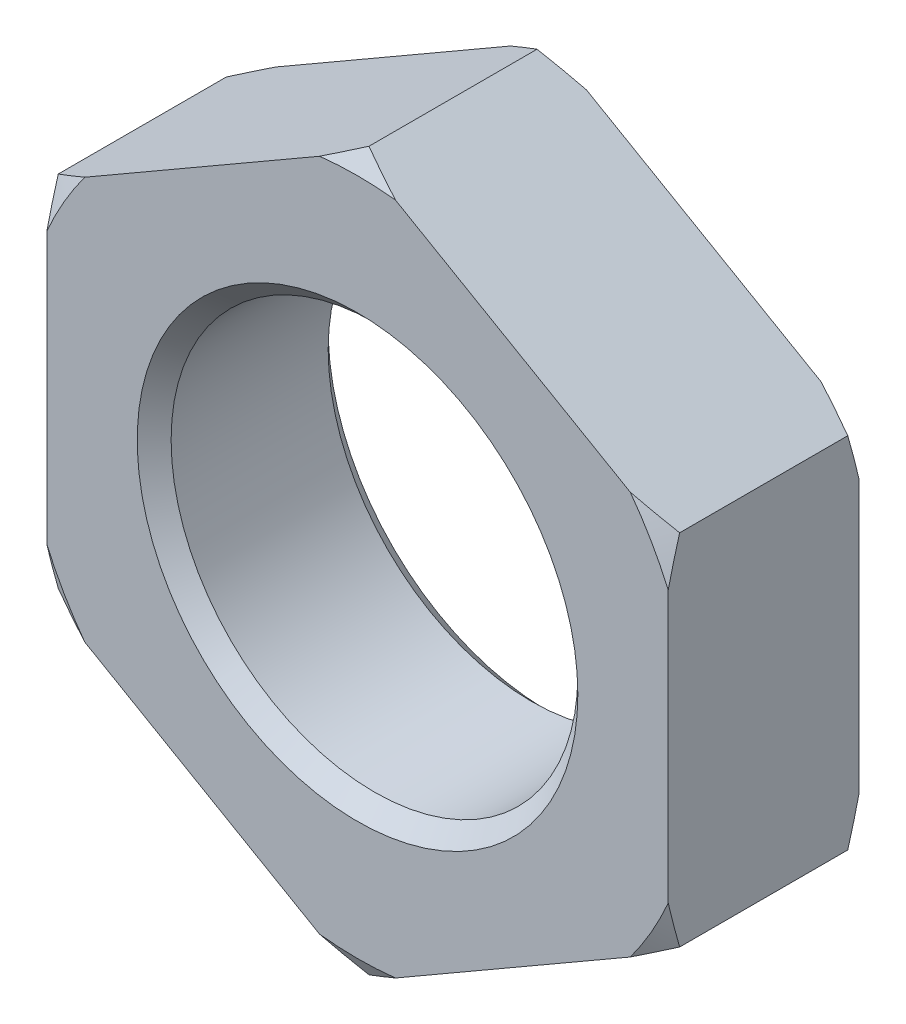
from build123d import *

# Parameters (mm, degrees)
SKETCH1_R           = 18
BOSS_EXTRUDE1_DEPTH = 8.45
CHAMFER1_SIZE       = 1.5


with BuildPart() as part:
    # Sketch1 → Boss-Extrude1 (new, symmetric)
    with BuildSketch(Plane.XY):
        Polygon((0, 31.754264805), (-27.5, 15.877132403), (-27.5, -15.877132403), (0, -31.754264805), (27.5, -15.877132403), (27.5, 15.877132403), align=None)
        Circle(SKETCH1_R, mode=Mode.SUBTRACT)
    extrude(amount=BOSS_EXTRUDE1_DEPTH, both=True)

    # Sketch3 → Cut-Revolve1 (revolve, cut)
    with BuildSketch(Plane(origin=(0, 0, 0), x_dir=(0, 0, -1), z_dir=(1, 0, 0))):
        Polygon((-8.45, 31.754264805), (-8.45, 30.004264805), (-7.439637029, 31.754264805), align=None)
    cut_revolve1 = revolve(axis=Axis((0, 0, -7.477018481), (0, 0, 1)), mode=Mode.SUBTRACT)

    # Mirror1: Cut-Revolve1 across plane
    add(cut_revolve1.mirror(Plane.XY), mode=Mode.SUBTRACT)

    # Chamfer1
    chamfer1_edges = [part.edges().sort_by_distance(p)[0] for p in [
        (-18, 0, -8.45),
        (-18, 0, 8.45),
    ]]
    chamfer(chamfer1_edges, length=CHAMFER1_SIZE)


solid = part.part
